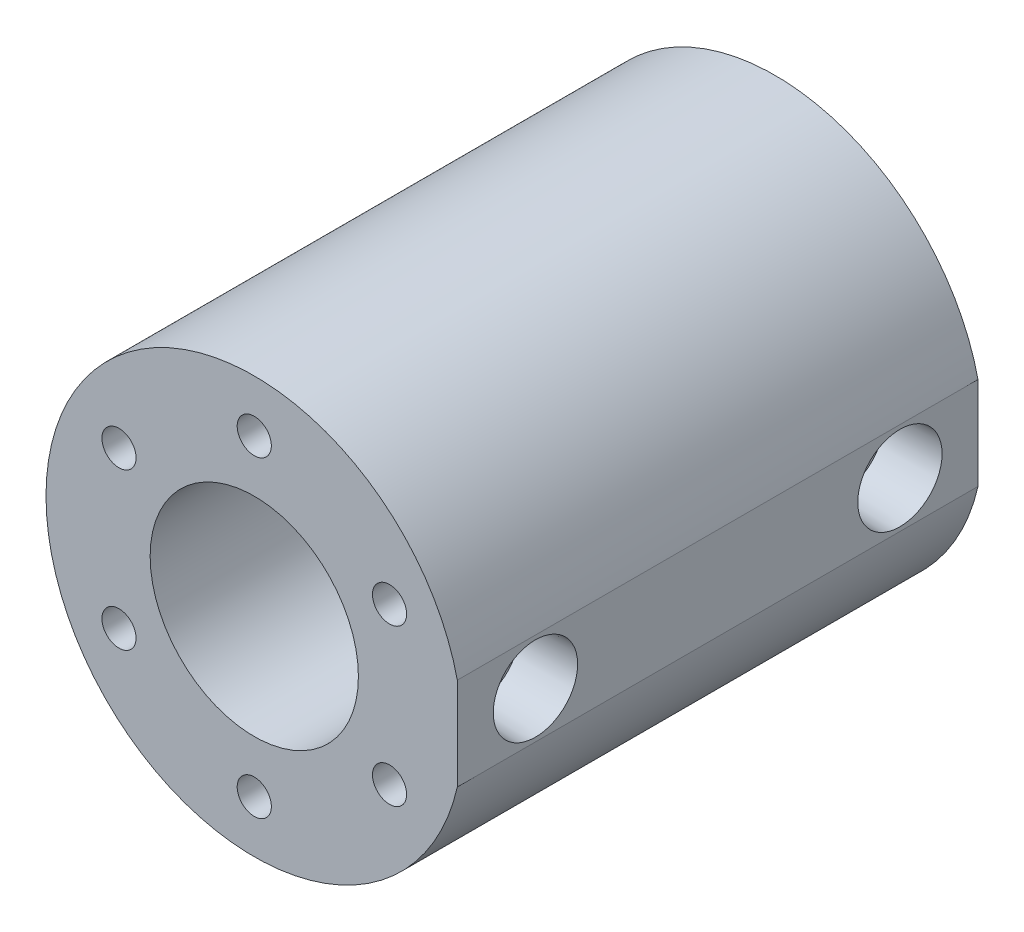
from build123d import *

# Parameters (mm, degrees)
SKETCH1_R                      = 12.7
EXTRUDE1_DEPTH                 = 31.75
F_8_32_TAPPED_HOLE1_AT_2_COUNT = 2
F_8_32_TAPPED_HOLE1_AT_2_PITCH = 38.1
F_8_32_TAPPED_HOLE1_AT_3_COUNT = 2
F_8_32_TAPPED_HOLE1_AT_3_PITCH = 32.995567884
F_8_32_TAPPED_HOLE1_AT_4_COUNT = 2
F_8_32_TAPPED_HOLE1_AT_4_PITCH = 19.05
F_8_32_TAPPED_HOLE1_AT_5_COUNT = 2
F_8_32_TAPPED_HOLE1_AT_5_PITCH = 19.05
F_8_32_TAPPED_HOLE1_AT_6_COUNT = 2
F_8_32_TAPPED_HOLE1_AT_6_PITCH = 32.995567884
STEAM_HOLES_AT_2_COUNT         = 2
STEAM_HOLES_AT_2_PITCH         = 44.45
CUT_EXTRUDE1_REACH             = 66.574
CUT_EXTRUDE1_END_RADIUS        = 12.7
SKETCH11_R                     = 3.175


with BuildPart() as part:
    # Sketch1 → Extrude1 (new, symmetric)
    with BuildSketch(Plane.XY):
        with BuildLine():
            Line((24.765, 5.644003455), (24.765, -5.644003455))
            ThreePointArc((24.765, -5.644003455), (-25.4, 0), (24.765, 5.644003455))
        make_face()
        Circle(SKETCH1_R, mode=Mode.SUBTRACT)
    extrude(amount=EXTRUDE1_DEPTH, both=True)

    # Sketch7 → 8-32 Tapped Hole1 (revolve, cut)
    with BuildSketch(Plane(origin=(-16.497783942, -9.525, 31.75), x_dir=(0, -1, 0), z_dir=(1, 0, 0))):
        Polygon((0, 0), (0, 21.205406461), (1.7272, 20.1676), (1.7272, 17.78), (2.0828, 17.78), (2.0828, 0), align=None)
    f_8_32_tapped_hole1 = revolve(axis=Axis((-16.497783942, -9.525, 38.1), (0, 0, -1)), mode=Mode.SUBTRACT)

    # 8-32 Tapped Hole1 at 2: 8-32 Tapped Hole1 ×2
    with Locations(*[Vector(0.8660254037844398, 0.49999999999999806, 0) * (i * F_8_32_TAPPED_HOLE1_AT_2_PITCH) for i in range(1, F_8_32_TAPPED_HOLE1_AT_2_COUNT)]):
        add(f_8_32_tapped_hole1, mode=Mode.SUBTRACT)

    # 8-32 Tapped Hole1 at 3: 8-32 Tapped Hole1 ×2
    with Locations(*[Vector(0.5000000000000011, 0.8660254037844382, 0) * (i * F_8_32_TAPPED_HOLE1_AT_3_PITCH) for i in range(1, F_8_32_TAPPED_HOLE1_AT_3_COUNT)]):
        add(f_8_32_tapped_hole1, mode=Mode.SUBTRACT)

    # 8-32 Tapped Hole1 at 4: 8-32 Tapped Hole1 ×2
    with Locations(*[(0, i * F_8_32_TAPPED_HOLE1_AT_4_PITCH, 0) for i in range(1, F_8_32_TAPPED_HOLE1_AT_4_COUNT)]):
        add(f_8_32_tapped_hole1, mode=Mode.SUBTRACT)

    # 8-32 Tapped Hole1 at 5: 8-32 Tapped Hole1 ×2
    with Locations(*[Vector(0.8660254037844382, -0.500000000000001, 0) * (i * F_8_32_TAPPED_HOLE1_AT_5_PITCH) for i in range(1, F_8_32_TAPPED_HOLE1_AT_5_COUNT)]):
        add(f_8_32_tapped_hole1, mode=Mode.SUBTRACT)

    # 8-32 Tapped Hole1 at 6: 8-32 Tapped Hole1 ×2
    with Locations(*[(i * F_8_32_TAPPED_HOLE1_AT_6_PITCH, 0, 0) for i in range(1, F_8_32_TAPPED_HOLE1_AT_6_COUNT)]):
        add(f_8_32_tapped_hole1, mode=Mode.SUBTRACT)

    # Mirror1: 8-32 Tapped Hole1 across plane
    add(f_8_32_tapped_hole1.mirror(Plane.XY), mode=Mode.SUBTRACT)

    # Mirror1 copy 1 sketch → Mirror1 copy 1 (revolve, cut)
    with BuildSketch(Plane(origin=(16.497783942, 9.525, -31.75), x_dir=(0, -1, 0), z_dir=(1, 0, 0))):
        Polygon((0, 0), (0, -21.205406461), (1.7272, -20.1676), (1.7272, -17.78), (2.0828, -17.78), (2.0828, 0), align=None)
    revolve(axis=Axis((16.497783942, 9.525, -38.1), (0, 0, -1)), mode=Mode.SUBTRACT)

    # Mirror1 copy 2 sketch → Mirror1 copy 2 (revolve, cut)
    with BuildSketch(Plane(origin=(0, 19.05, -31.75), x_dir=(0, -1, 0), z_dir=(1, 0, 0))):
        Polygon((0, 0), (0, -21.205406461), (1.7272, -20.1676), (1.7272, -17.78), (2.0828, -17.78), (2.0828, 0), align=None)
    revolve(axis=Axis((0, 19.05, -38.1), (0, 0, -1)), mode=Mode.SUBTRACT)

    # Mirror1 copy 3 sketch → Mirror1 copy 3 (revolve, cut)
    with BuildSketch(Plane(origin=(-16.497783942, 9.525, -31.75), x_dir=(0, -1, 0), z_dir=(1, 0, 0))):
        Polygon((0, 0), (0, -21.205406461), (1.7272, -20.1676), (1.7272, -17.78), (2.0828, -17.78), (2.0828, 0), align=None)
    revolve(axis=Axis((-16.497783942, 9.525, -38.1), (0, 0, -1)), mode=Mode.SUBTRACT)

    # Mirror1 copy 4 sketch → Mirror1 copy 4 (revolve, cut)
    with BuildSketch(Plane(origin=(0, -19.05, -31.75), x_dir=(0, -1, 0), z_dir=(1, 0, 0))):
        Polygon((0, 0), (0, -21.205406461), (1.7272, -20.1676), (1.7272, -17.78), (2.0828, -17.78), (2.0828, 0), align=None)
    revolve(axis=Axis((0, -19.05, -38.1), (0, 0, -1)), mode=Mode.SUBTRACT)

    # Mirror1 copy 5 sketch → Mirror1 copy 5 (revolve, cut)
    with BuildSketch(Plane(origin=(16.497783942, -9.525, -31.75), x_dir=(0, -1, 0), z_dir=(1, 0, 0))):
        Polygon((0, 0), (0, -21.205406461), (1.7272, -20.1676), (1.7272, -17.78), (2.0828, -17.78), (2.0828, 0), align=None)
    revolve(axis=Axis((16.497783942, -9.525, -38.1), (0, 0, -1)), mode=Mode.SUBTRACT)

    # Sketch9 → Steam Holes (revolve, cut)
    with BuildSketch(Plane(origin=(24.765, 0, -22.225), x_dir=(0, 0, -1), z_dir=(0, 1, 0))):
        Polygon((0, 0), (0, 11.423468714), (4.2164, 8.89), (4.2164, 6.92404), (4.93618497, 6.92404), (5.1435, 0), align=None)
    steam_holes = revolve(axis=Axis((31.115, 0, -22.225), (-1, 0, 0)), mode=Mode.SUBTRACT)

    # Steam Holes at 2: Steam Holes ×2
    with Locations(*[(0, 0, i * STEAM_HOLES_AT_2_PITCH) for i in range(1, STEAM_HOLES_AT_2_COUNT)]):
        add(steam_holes, mode=Mode.SUBTRACT)

    # Cut-Extrude1: up to this cylinder (the profile starts outside it)
    cut_extrude1_end = Plane(origin=(0, 0, 0), z_dir=(0, 0, -1)) * Cylinder(CUT_EXTRUDE1_END_RADIUS, 203.998, mode=Mode.PRIVATE)
    # Sketch11 → Cut-Extrude1 (cut, up to the surface)
    with BuildSketch(Plane(origin=(24.765, 0, 0), x_dir=(0, 0, -1), z_dir=(1, 0, 0)), mode=Mode.PRIVATE) as cut_extrude1_sk1:
        with Locations((22.225, 0)):
            Circle(SKETCH11_R)
    cut_extrude1_tool1 = extrude(cut_extrude1_sk1.sketch, amount=-CUT_EXTRUDE1_REACH, mode=Mode.PRIVATE) - cut_extrude1_end
    add(cut_extrude1_tool1.solids().sort_by_distance((24.765, 0, -22.225))[0], mode=Mode.SUBTRACT)
    # Sketch11 → Cut-Extrude1 (cut, up to the surface)
    with BuildSketch(Plane(origin=(24.765, 0, 0), x_dir=(0, 0, -1), z_dir=(1, 0, 0)), mode=Mode.PRIVATE) as cut_extrude1_sk2:
        with Locations((-22.225, 0)):
            Circle(SKETCH11_R)
    cut_extrude1_tool2 = extrude(cut_extrude1_sk2.sketch, amount=-CUT_EXTRUDE1_REACH, mode=Mode.PRIVATE) - cut_extrude1_end
    add(cut_extrude1_tool2.solids().sort_by_distance((24.765, 0, 22.225))[0], mode=Mode.SUBTRACT)


solid = part.part
